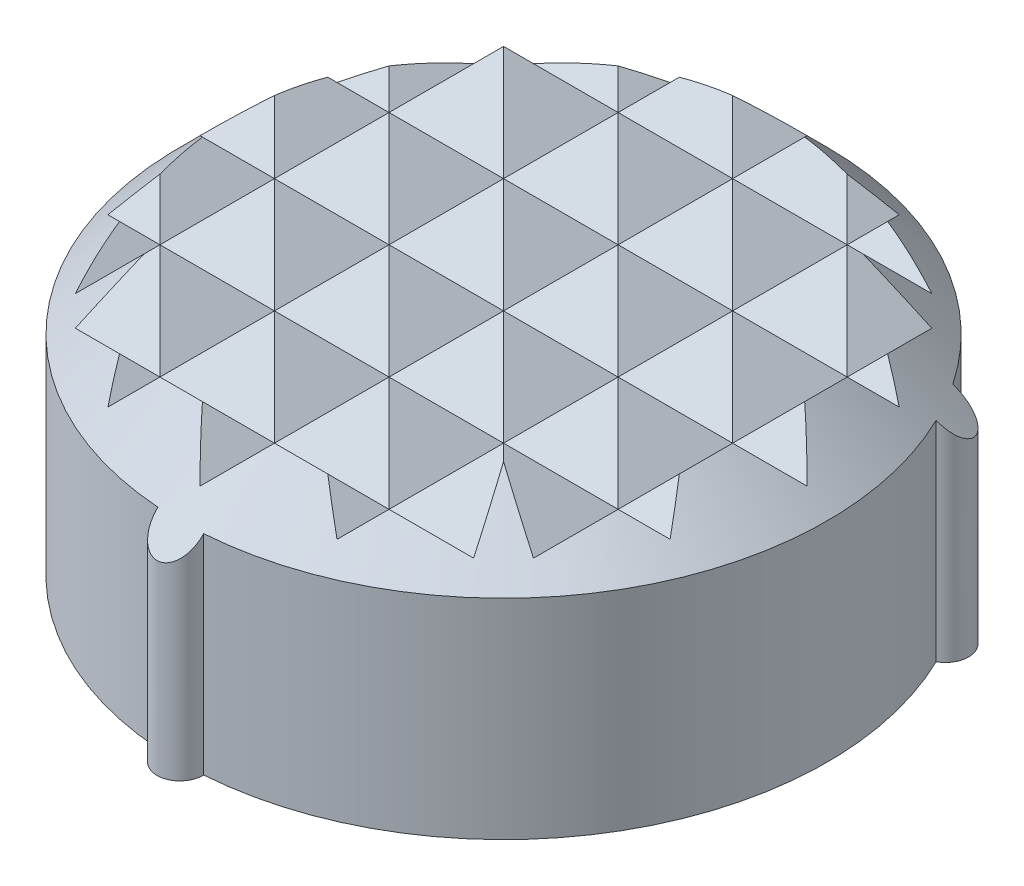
from build123d import *

# Parameters (mm, degrees)
SKETCH1_W             = 6.05
SKETCH1_H             = 5
SKETCH2_R             = 6.55
EXTRUDE1_DEPTH        = 10.909843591
EXTRUDE2_DEPTH        = 10.670832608
LPATTERN1_COUNT       = 8
LPATTERN1_PITCH       = 2
LPATTERN1_COUNT_DIR2  = 8
LPATTERN1_PITCH_DIR2  = 2
MIRROR1_COPY_1_DEPTH  = 10.670832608
MIRROR1_COPY_2_DEPTH  = 10.670832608
MIRROR1_COPY_3_DEPTH  = 10.670832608
MIRROR1_COPY_4_DEPTH  = 10.670832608
MIRROR1_COPY_5_DEPTH  = 10.670832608
MIRROR1_COPY_6_DEPTH  = 10.670832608
MIRROR1_COPY_7_DEPTH  = 10.670832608
MIRROR1_COPY_8_DEPTH  = 10.670832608
MIRROR1_COPY_9_DEPTH  = 10.670832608
MIRROR1_COPY_10_DEPTH = 10.670832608
MIRROR1_COPY_11_DEPTH = 10.670832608
MIRROR1_COPY_12_DEPTH = 10.670832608
MIRROR1_COPY_13_DEPTH = 10.670832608
MIRROR1_COPY_14_DEPTH = 10.670832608
MIRROR1_COPY_15_DEPTH = 10.670832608
MIRROR1_COPY_16_DEPTH = 10.670832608
MIRROR1_COPY_17_DEPTH = 10.670832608
MIRROR1_COPY_18_DEPTH = 10.670832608
MIRROR1_COPY_19_DEPTH = 10.670832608
MIRROR1_COPY_20_DEPTH = 10.670832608
MIRROR1_COPY_21_DEPTH = 10.670832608
MIRROR1_COPY_22_DEPTH = 10.670832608
MIRROR1_COPY_23_DEPTH = 10.670832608
MIRROR1_COPY_24_DEPTH = 10.670832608
MIRROR1_COPY_25_DEPTH = 10.670832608
MIRROR1_COPY_26_DEPTH = 10.670832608
MIRROR1_COPY_27_DEPTH = 10.670832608
MIRROR1_COPY_28_DEPTH = 10.670832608
MIRROR1_COPY_29_DEPTH = 10.670832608
MIRROR1_COPY_30_DEPTH = 10.670832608
MIRROR1_COPY_31_DEPTH = 10.670832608
MIRROR1_COPY_32_DEPTH = 10.670832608
MIRROR1_COPY_33_DEPTH = 10.670832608
MIRROR1_COPY_34_DEPTH = 10.670832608
MIRROR1_COPY_35_DEPTH = 10.670832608
MIRROR1_COPY_36_DEPTH = 10.670832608
MIRROR1_COPY_37_DEPTH = 10.670832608
MIRROR1_COPY_38_DEPTH = 10.670832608
MIRROR1_COPY_39_DEPTH = 10.670832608
MIRROR1_COPY_40_DEPTH = 10.670832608
MIRROR1_COPY_41_DEPTH = 10.670832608
MIRROR1_COPY_42_DEPTH = 10.670832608
MIRROR1_COPY_43_DEPTH = 10.670832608
MIRROR1_COPY_44_DEPTH = 10.670832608
MIRROR1_COPY_45_DEPTH = 10.670832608
MIRROR1_COPY_46_DEPTH = 10.670832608
MIRROR1_COPY_47_DEPTH = 10.670832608
MIRROR1_COPY_48_DEPTH = 10.670832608
MIRROR1_COPY_49_DEPTH = 10.670832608
MIRROR1_COPY_50_DEPTH = 10.670832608
MIRROR1_COPY_51_DEPTH = 10.670832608
MIRROR1_COPY_52_DEPTH = 10.670832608
MIRROR1_COPY_53_DEPTH = 10.670832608
MIRROR1_COPY_54_DEPTH = 10.670832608
MIRROR1_COPY_55_DEPTH = 10.670832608
MIRROR1_COPY_56_DEPTH = 10.670832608
MIRROR1_COPY_57_DEPTH = 10.670832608
MIRROR1_COPY_58_DEPTH = 10.670832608
MIRROR1_COPY_59_DEPTH = 10.670832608
MIRROR1_COPY_60_DEPTH = 10.670832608
MIRROR1_COPY_61_DEPTH = 10.670832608
MIRROR1_COPY_62_DEPTH = 10.670832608
MIRROR1_COPY_63_DEPTH = 10.670832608


with BuildPart() as part:
    # Sketch1 → Revolve1 (revolve)
    with BuildSketch(Plane.XY, mode=Mode.PRIVATE) as revolve1_sk:
        with Locations((3.025, 2.5)):
            Rectangle(SKETCH1_W, SKETCH1_H)
    revolve(revolve1_sk.sketch.rotate(Axis((0, 0, 0), (0, -1, 0)), 90), axis=Axis((0, 0, 0), (0, -1, 0)))

    # Sketch2 → Extrude1 (cut, through all)
    with BuildSketch(Plane(origin=(0, 0, 0), x_dir=(1, 0, 0), z_dir=(0, 1, 0))):
        Circle(SKETCH2_R)
        with BuildLine():
            ThreePointArc((0.399749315, -5.635840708), (4.893043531, -2.825), (5.080655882, 2.471727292))
            ThreePointArc((5.080655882, 2.471727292), (5.239453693, 3.025), (4.680906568, 3.164113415))
            ThreePointArc((4.680906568, 3.164113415), (0, 5.65), (-4.680906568, 3.164113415))
            ThreePointArc((-4.680906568, 3.164113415), (-5.239453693, 3.025), (-5.080655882, 2.471727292))
            ThreePointArc((-5.080655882, 2.471727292), (-4.893043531, -2.825), (-0.399749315, -5.635840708))
            ThreePointArc((-0.399749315, -5.635840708), (0, -6.05), (0.399749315, -5.635840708))
        make_face(mode=Mode.SUBTRACT)
    extrude(amount=EXTRUDE1_DEPTH, mode=Mode.SUBTRACT)

    # Sketch6 → Cut-Revolve1 (revolve, cut)
    with BuildSketch(Plane(origin=(0, 0, 0), x_dir=(0, 0, -1), z_dir=(1, 0, 0)), mode=Mode.PRIVATE) as cut_revolve1_sk:
        Polygon((-8.3, 1), (-8.3, 5), (-4.3, 5), align=None)
    revolve(cut_revolve1_sk.sketch.rotate(Axis((0, 0, 0), (0, 1, 0)), 180), axis=Axis((0, 0, 0), (0, 1, 0)), mode=Mode.SUBTRACT)

    # Sketch5 → Extrude2 (cut, symmetric)
    with BuildSketch(Plane.XY):
        Polygon((1, 5), (0, 4), (-1, 5), align=None)
    extrude2 = extrude(amount=EXTRUDE2_DEPTH, both=True, mode=Mode.SUBTRACT)

    # LPattern1: Extrude2 8 × 8
    with Locations(*[Vector(-1, 0, 0) * (i * LPATTERN1_PITCH) + Vector(1, 0, 0) * (j * LPATTERN1_PITCH_DIR2) for i in range(LPATTERN1_COUNT) for j in range(LPATTERN1_COUNT_DIR2) if (i, j) != (0, 0)]):
        add(extrude2, mode=Mode.SUBTRACT)

    # Mirror1: Extrude2 across plane
    add(extrude2.mirror(Plane(origin=(0, 0, 0), x_dir=(-0.7071067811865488, 0, 0.7071067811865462), z_dir=(0.7071067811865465, 0, 0.7071067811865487))), mode=Mode.SUBTRACT)

    # Mirror1 copy 1 sketch → Mirror1 copy 1 (cut, symmetric)
    with BuildSketch(Plane(origin=(0, 0, -2), x_dir=(0, 0, -1), z_dir=(-1, 0, 0))):
        Polygon((1, -5), (0, -4), (-1, -5), align=None)
    extrude(amount=MIRROR1_COPY_1_DEPTH, both=True, mode=Mode.SUBTRACT)

    # Mirror1 copy 2 sketch → Mirror1 copy 2 (cut, symmetric)
    with BuildSketch(Plane(origin=(0, 0, -4), x_dir=(0, 0, -1), z_dir=(-1, 0, 0))):
        Polygon((1, -5), (0, -4), (-1, -5), align=None)
    extrude(amount=MIRROR1_COPY_2_DEPTH, both=True, mode=Mode.SUBTRACT)

    # Mirror1 copy 3 sketch → Mirror1 copy 3 (cut, symmetric)
    with BuildSketch(Plane(origin=(0, 0, -6), x_dir=(0, 0, -1), z_dir=(-1, 0, 0))):
        Polygon((1, -5), (0, -4), (-1, -5), align=None)
    extrude(amount=MIRROR1_COPY_3_DEPTH, both=True, mode=Mode.SUBTRACT)

    # Mirror1 copy 4 sketch → Mirror1 copy 4 (cut, symmetric)
    with BuildSketch(Plane(origin=(0, 0, -8), x_dir=(0, 0, -1), z_dir=(-1, 0, 0))):
        Polygon((1, -5), (0, -4), (-1, -5), align=None)
    extrude(amount=MIRROR1_COPY_4_DEPTH, both=True, mode=Mode.SUBTRACT)

    # Mirror1 copy 5 sketch → Mirror1 copy 5 (cut, symmetric)
    with BuildSketch(Plane(origin=(0, 0, -10), x_dir=(0, 0, -1), z_dir=(-1, 0, 0))):
        Polygon((1, -5), (0, -4), (-1, -5), align=None)
    extrude(amount=MIRROR1_COPY_5_DEPTH, both=True, mode=Mode.SUBTRACT)

    # Mirror1 copy 6 sketch → Mirror1 copy 6 (cut, symmetric)
    with BuildSketch(Plane(origin=(0, 0, -12), x_dir=(0, 0, -1), z_dir=(-1, 0, 0))):
        Polygon((1, -5), (0, -4), (-1, -5), align=None)
    extrude(amount=MIRROR1_COPY_6_DEPTH, both=True, mode=Mode.SUBTRACT)

    # Mirror1 copy 7 sketch → Mirror1 copy 7 (cut, symmetric)
    with BuildSketch(Plane(origin=(0, 0, -14), x_dir=(0, 0, -1), z_dir=(-1, 0, 0))):
        Polygon((1, -5), (0, -4), (-1, -5), align=None)
    extrude(amount=MIRROR1_COPY_7_DEPTH, both=True, mode=Mode.SUBTRACT)

    # Mirror1 copy 8 sketch → Mirror1 copy 8 (cut, symmetric)
    with BuildSketch(Plane(origin=(0, 0, 2), x_dir=(0, 0, -1), z_dir=(-1, 0, 0))):
        Polygon((1, -5), (0, -4), (-1, -5), align=None)
    extrude(amount=MIRROR1_COPY_8_DEPTH, both=True, mode=Mode.SUBTRACT)

    # Mirror1 copy 9 sketch → Mirror1 copy 9 (cut, symmetric)
    with BuildSketch(Plane(origin=(0, 0, 0), x_dir=(0, 0, -1), z_dir=(-1, 0, 0))):
        Polygon((1, -5), (0, -4), (-1, -5), align=None)
    extrude(amount=MIRROR1_COPY_9_DEPTH, both=True, mode=Mode.SUBTRACT)

    # Mirror1 copy 10 sketch → Mirror1 copy 10 (cut, symmetric)
    with BuildSketch(Plane(origin=(0, 0, -2), x_dir=(0, 0, -1), z_dir=(-1, 0, 0))):
        Polygon((1, -5), (0, -4), (-1, -5), align=None)
    extrude(amount=MIRROR1_COPY_10_DEPTH, both=True, mode=Mode.SUBTRACT)

    # Mirror1 copy 11 sketch → Mirror1 copy 11 (cut, symmetric)
    with BuildSketch(Plane(origin=(0, 0, -4), x_dir=(0, 0, -1), z_dir=(-1, 0, 0))):
        Polygon((1, -5), (0, -4), (-1, -5), align=None)
    extrude(amount=MIRROR1_COPY_11_DEPTH, both=True, mode=Mode.SUBTRACT)

    # Mirror1 copy 12 sketch → Mirror1 copy 12 (cut, symmetric)
    with BuildSketch(Plane(origin=(0, 0, -6), x_dir=(0, 0, -1), z_dir=(-1, 0, 0))):
        Polygon((1, -5), (0, -4), (-1, -5), align=None)
    extrude(amount=MIRROR1_COPY_12_DEPTH, both=True, mode=Mode.SUBTRACT)

    # Mirror1 copy 13 sketch → Mirror1 copy 13 (cut, symmetric)
    with BuildSketch(Plane(origin=(0, 0, -8), x_dir=(0, 0, -1), z_dir=(-1, 0, 0))):
        Polygon((1, -5), (0, -4), (-1, -5), align=None)
    extrude(amount=MIRROR1_COPY_13_DEPTH, both=True, mode=Mode.SUBTRACT)

    # Mirror1 copy 14 sketch → Mirror1 copy 14 (cut, symmetric)
    with BuildSketch(Plane(origin=(0, 0, -10), x_dir=(0, 0, -1), z_dir=(-1, 0, 0))):
        Polygon((1, -5), (0, -4), (-1, -5), align=None)
    extrude(amount=MIRROR1_COPY_14_DEPTH, both=True, mode=Mode.SUBTRACT)

    # Mirror1 copy 15 sketch → Mirror1 copy 15 (cut, symmetric)
    with BuildSketch(Plane(origin=(0, 0, -12), x_dir=(0, 0, -1), z_dir=(-1, 0, 0))):
        Polygon((1, -5), (0, -4), (-1, -5), align=None)
    extrude(amount=MIRROR1_COPY_15_DEPTH, both=True, mode=Mode.SUBTRACT)

    # Mirror1 copy 16 sketch → Mirror1 copy 16 (cut, symmetric)
    with BuildSketch(Plane(origin=(0, 0, 4), x_dir=(0, 0, -1), z_dir=(-1, 0, 0))):
        Polygon((1, -5), (0, -4), (-1, -5), align=None)
    extrude(amount=MIRROR1_COPY_16_DEPTH, both=True, mode=Mode.SUBTRACT)

    # Mirror1 copy 17 sketch → Mirror1 copy 17 (cut, symmetric)
    with BuildSketch(Plane(origin=(0, 0, 2), x_dir=(0, 0, -1), z_dir=(-1, 0, 0))):
        Polygon((1, -5), (0, -4), (-1, -5), align=None)
    extrude(amount=MIRROR1_COPY_17_DEPTH, both=True, mode=Mode.SUBTRACT)

    # Mirror1 copy 18 sketch → Mirror1 copy 18 (cut, symmetric)
    with BuildSketch(Plane(origin=(0, 0, 0), x_dir=(0, 0, -1), z_dir=(-1, 0, 0))):
        Polygon((1, -5), (0, -4), (-1, -5), align=None)
    extrude(amount=MIRROR1_COPY_18_DEPTH, both=True, mode=Mode.SUBTRACT)

    # Mirror1 copy 19 sketch → Mirror1 copy 19 (cut, symmetric)
    with BuildSketch(Plane(origin=(0, 0, -2), x_dir=(0, 0, -1), z_dir=(-1, 0, 0))):
        Polygon((1, -5), (0, -4), (-1, -5), align=None)
    extrude(amount=MIRROR1_COPY_19_DEPTH, both=True, mode=Mode.SUBTRACT)

    # Mirror1 copy 20 sketch → Mirror1 copy 20 (cut, symmetric)
    with BuildSketch(Plane(origin=(0, 0, -4), x_dir=(0, 0, -1), z_dir=(-1, 0, 0))):
        Polygon((1, -5), (0, -4), (-1, -5), align=None)
    extrude(amount=MIRROR1_COPY_20_DEPTH, both=True, mode=Mode.SUBTRACT)

    # Mirror1 copy 21 sketch → Mirror1 copy 21 (cut, symmetric)
    with BuildSketch(Plane(origin=(0, 0, -6), x_dir=(0, 0, -1), z_dir=(-1, 0, 0))):
        Polygon((1, -5), (0, -4), (-1, -5), align=None)
    extrude(amount=MIRROR1_COPY_21_DEPTH, both=True, mode=Mode.SUBTRACT)

    # Mirror1 copy 22 sketch → Mirror1 copy 22 (cut, symmetric)
    with BuildSketch(Plane(origin=(0, 0, -8), x_dir=(0, 0, -1), z_dir=(-1, 0, 0))):
        Polygon((1, -5), (0, -4), (-1, -5), align=None)
    extrude(amount=MIRROR1_COPY_22_DEPTH, both=True, mode=Mode.SUBTRACT)

    # Mirror1 copy 23 sketch → Mirror1 copy 23 (cut, symmetric)
    with BuildSketch(Plane(origin=(0, 0, -10), x_dir=(0, 0, -1), z_dir=(-1, 0, 0))):
        Polygon((1, -5), (0, -4), (-1, -5), align=None)
    extrude(amount=MIRROR1_COPY_23_DEPTH, both=True, mode=Mode.SUBTRACT)

    # Mirror1 copy 24 sketch → Mirror1 copy 24 (cut, symmetric)
    with BuildSketch(Plane(origin=(0, 0, 6), x_dir=(0, 0, -1), z_dir=(-1, 0, 0))):
        Polygon((1, -5), (0, -4), (-1, -5), align=None)
    extrude(amount=MIRROR1_COPY_24_DEPTH, both=True, mode=Mode.SUBTRACT)

    # Mirror1 copy 25 sketch → Mirror1 copy 25 (cut, symmetric)
    with BuildSketch(Plane(origin=(0, 0, 4), x_dir=(0, 0, -1), z_dir=(-1, 0, 0))):
        Polygon((1, -5), (0, -4), (-1, -5), align=None)
    extrude(amount=MIRROR1_COPY_25_DEPTH, both=True, mode=Mode.SUBTRACT)

    # Mirror1 copy 26 sketch → Mirror1 copy 26 (cut, symmetric)
    with BuildSketch(Plane(origin=(0, 0, 2), x_dir=(0, 0, -1), z_dir=(-1, 0, 0))):
        Polygon((1, -5), (0, -4), (-1, -5), align=None)
    extrude(amount=MIRROR1_COPY_26_DEPTH, both=True, mode=Mode.SUBTRACT)

    # Mirror1 copy 27 sketch → Mirror1 copy 27 (cut, symmetric)
    with BuildSketch(Plane(origin=(0, 0, 0), x_dir=(0, 0, -1), z_dir=(-1, 0, 0))):
        Polygon((1, -5), (0, -4), (-1, -5), align=None)
    extrude(amount=MIRROR1_COPY_27_DEPTH, both=True, mode=Mode.SUBTRACT)

    # Mirror1 copy 28 sketch → Mirror1 copy 28 (cut, symmetric)
    with BuildSketch(Plane(origin=(0, 0, -2), x_dir=(0, 0, -1), z_dir=(-1, 0, 0))):
        Polygon((1, -5), (0, -4), (-1, -5), align=None)
    extrude(amount=MIRROR1_COPY_28_DEPTH, both=True, mode=Mode.SUBTRACT)

    # Mirror1 copy 29 sketch → Mirror1 copy 29 (cut, symmetric)
    with BuildSketch(Plane(origin=(0, 0, -4), x_dir=(0, 0, -1), z_dir=(-1, 0, 0))):
        Polygon((1, -5), (0, -4), (-1, -5), align=None)
    extrude(amount=MIRROR1_COPY_29_DEPTH, both=True, mode=Mode.SUBTRACT)

    # Mirror1 copy 30 sketch → Mirror1 copy 30 (cut, symmetric)
    with BuildSketch(Plane(origin=(0, 0, -6), x_dir=(0, 0, -1), z_dir=(-1, 0, 0))):
        Polygon((1, -5), (0, -4), (-1, -5), align=None)
    extrude(amount=MIRROR1_COPY_30_DEPTH, both=True, mode=Mode.SUBTRACT)

    # Mirror1 copy 31 sketch → Mirror1 copy 31 (cut, symmetric)
    with BuildSketch(Plane(origin=(0, 0, -8), x_dir=(0, 0, -1), z_dir=(-1, 0, 0))):
        Polygon((1, -5), (0, -4), (-1, -5), align=None)
    extrude(amount=MIRROR1_COPY_31_DEPTH, both=True, mode=Mode.SUBTRACT)

    # Mirror1 copy 32 sketch → Mirror1 copy 32 (cut, symmetric)
    with BuildSketch(Plane(origin=(0, 0, 8), x_dir=(0, 0, -1), z_dir=(-1, 0, 0))):
        Polygon((1, -5), (0, -4), (-1, -5), align=None)
    extrude(amount=MIRROR1_COPY_32_DEPTH, both=True, mode=Mode.SUBTRACT)

    # Mirror1 copy 33 sketch → Mirror1 copy 33 (cut, symmetric)
    with BuildSketch(Plane(origin=(0, 0, 6), x_dir=(0, 0, -1), z_dir=(-1, 0, 0))):
        Polygon((1, -5), (0, -4), (-1, -5), align=None)
    extrude(amount=MIRROR1_COPY_33_DEPTH, both=True, mode=Mode.SUBTRACT)

    # Mirror1 copy 34 sketch → Mirror1 copy 34 (cut, symmetric)
    with BuildSketch(Plane(origin=(0, 0, 4), x_dir=(0, 0, -1), z_dir=(-1, 0, 0))):
        Polygon((1, -5), (0, -4), (-1, -5), align=None)
    extrude(amount=MIRROR1_COPY_34_DEPTH, both=True, mode=Mode.SUBTRACT)

    # Mirror1 copy 35 sketch → Mirror1 copy 35 (cut, symmetric)
    with BuildSketch(Plane(origin=(0, 0, 2), x_dir=(0, 0, -1), z_dir=(-1, 0, 0))):
        Polygon((1, -5), (0, -4), (-1, -5), align=None)
    extrude(amount=MIRROR1_COPY_35_DEPTH, both=True, mode=Mode.SUBTRACT)

    # Mirror1 copy 36 sketch → Mirror1 copy 36 (cut, symmetric)
    with BuildSketch(Plane(origin=(0, 0, 0), x_dir=(0, 0, -1), z_dir=(-1, 0, 0))):
        Polygon((1, -5), (0, -4), (-1, -5), align=None)
    extrude(amount=MIRROR1_COPY_36_DEPTH, both=True, mode=Mode.SUBTRACT)

    # Mirror1 copy 37 sketch → Mirror1 copy 37 (cut, symmetric)
    with BuildSketch(Plane(origin=(0, 0, -2), x_dir=(0, 0, -1), z_dir=(-1, 0, 0))):
        Polygon((1, -5), (0, -4), (-1, -5), align=None)
    extrude(amount=MIRROR1_COPY_37_DEPTH, both=True, mode=Mode.SUBTRACT)

    # Mirror1 copy 38 sketch → Mirror1 copy 38 (cut, symmetric)
    with BuildSketch(Plane(origin=(0, 0, -4), x_dir=(0, 0, -1), z_dir=(-1, 0, 0))):
        Polygon((1, -5), (0, -4), (-1, -5), align=None)
    extrude(amount=MIRROR1_COPY_38_DEPTH, both=True, mode=Mode.SUBTRACT)

    # Mirror1 copy 39 sketch → Mirror1 copy 39 (cut, symmetric)
    with BuildSketch(Plane(origin=(0, 0, -6), x_dir=(0, 0, -1), z_dir=(-1, 0, 0))):
        Polygon((1, -5), (0, -4), (-1, -5), align=None)
    extrude(amount=MIRROR1_COPY_39_DEPTH, both=True, mode=Mode.SUBTRACT)

    # Mirror1 copy 40 sketch → Mirror1 copy 40 (cut, symmetric)
    with BuildSketch(Plane(origin=(0, 0, 10), x_dir=(0, 0, -1), z_dir=(-1, 0, 0))):
        Polygon((1, -5), (0, -4), (-1, -5), align=None)
    extrude(amount=MIRROR1_COPY_40_DEPTH, both=True, mode=Mode.SUBTRACT)

    # Mirror1 copy 41 sketch → Mirror1 copy 41 (cut, symmetric)
    with BuildSketch(Plane(origin=(0, 0, 8), x_dir=(0, 0, -1), z_dir=(-1, 0, 0))):
        Polygon((1, -5), (0, -4), (-1, -5), align=None)
    extrude(amount=MIRROR1_COPY_41_DEPTH, both=True, mode=Mode.SUBTRACT)

    # Mirror1 copy 42 sketch → Mirror1 copy 42 (cut, symmetric)
    with BuildSketch(Plane(origin=(0, 0, 6), x_dir=(0, 0, -1), z_dir=(-1, 0, 0))):
        Polygon((1, -5), (0, -4), (-1, -5), align=None)
    extrude(amount=MIRROR1_COPY_42_DEPTH, both=True, mode=Mode.SUBTRACT)

    # Mirror1 copy 43 sketch → Mirror1 copy 43 (cut, symmetric)
    with BuildSketch(Plane(origin=(0, 0, 4), x_dir=(0, 0, -1), z_dir=(-1, 0, 0))):
        Polygon((1, -5), (0, -4), (-1, -5), align=None)
    extrude(amount=MIRROR1_COPY_43_DEPTH, both=True, mode=Mode.SUBTRACT)

    # Mirror1 copy 44 sketch → Mirror1 copy 44 (cut, symmetric)
    with BuildSketch(Plane(origin=(0, 0, 2), x_dir=(0, 0, -1), z_dir=(-1, 0, 0))):
        Polygon((1, -5), (0, -4), (-1, -5), align=None)
    extrude(amount=MIRROR1_COPY_44_DEPTH, both=True, mode=Mode.SUBTRACT)

    # Mirror1 copy 45 sketch → Mirror1 copy 45 (cut, symmetric)
    with BuildSketch(Plane(origin=(0, 0, 0), x_dir=(0, 0, -1), z_dir=(-1, 0, 0))):
        Polygon((1, -5), (0, -4), (-1, -5), align=None)
    extrude(amount=MIRROR1_COPY_45_DEPTH, both=True, mode=Mode.SUBTRACT)

    # Mirror1 copy 46 sketch → Mirror1 copy 46 (cut, symmetric)
    with BuildSketch(Plane(origin=(0, 0, -2), x_dir=(0, 0, -1), z_dir=(-1, 0, 0))):
        Polygon((1, -5), (0, -4), (-1, -5), align=None)
    extrude(amount=MIRROR1_COPY_46_DEPTH, both=True, mode=Mode.SUBTRACT)

    # Mirror1 copy 47 sketch → Mirror1 copy 47 (cut, symmetric)
    with BuildSketch(Plane(origin=(0, 0, -4), x_dir=(0, 0, -1), z_dir=(-1, 0, 0))):
        Polygon((1, -5), (0, -4), (-1, -5), align=None)
    extrude(amount=MIRROR1_COPY_47_DEPTH, both=True, mode=Mode.SUBTRACT)

    # Mirror1 copy 48 sketch → Mirror1 copy 48 (cut, symmetric)
    with BuildSketch(Plane(origin=(0, 0, 12), x_dir=(0, 0, -1), z_dir=(-1, 0, 0))):
        Polygon((1, -5), (0, -4), (-1, -5), align=None)
    extrude(amount=MIRROR1_COPY_48_DEPTH, both=True, mode=Mode.SUBTRACT)

    # Mirror1 copy 49 sketch → Mirror1 copy 49 (cut, symmetric)
    with BuildSketch(Plane(origin=(0, 0, 10), x_dir=(0, 0, -1), z_dir=(-1, 0, 0))):
        Polygon((1, -5), (0, -4), (-1, -5), align=None)
    extrude(amount=MIRROR1_COPY_49_DEPTH, both=True, mode=Mode.SUBTRACT)

    # Mirror1 copy 50 sketch → Mirror1 copy 50 (cut, symmetric)
    with BuildSketch(Plane(origin=(0, 0, 8), x_dir=(0, 0, -1), z_dir=(-1, 0, 0))):
        Polygon((1, -5), (0, -4), (-1, -5), align=None)
    extrude(amount=MIRROR1_COPY_50_DEPTH, both=True, mode=Mode.SUBTRACT)

    # Mirror1 copy 51 sketch → Mirror1 copy 51 (cut, symmetric)
    with BuildSketch(Plane(origin=(0, 0, 6), x_dir=(0, 0, -1), z_dir=(-1, 0, 0))):
        Polygon((1, -5), (0, -4), (-1, -5), align=None)
    extrude(amount=MIRROR1_COPY_51_DEPTH, both=True, mode=Mode.SUBTRACT)

    # Mirror1 copy 52 sketch → Mirror1 copy 52 (cut, symmetric)
    with BuildSketch(Plane(origin=(0, 0, 4), x_dir=(0, 0, -1), z_dir=(-1, 0, 0))):
        Polygon((1, -5), (0, -4), (-1, -5), align=None)
    extrude(amount=MIRROR1_COPY_52_DEPTH, both=True, mode=Mode.SUBTRACT)

    # Mirror1 copy 53 sketch → Mirror1 copy 53 (cut, symmetric)
    with BuildSketch(Plane(origin=(0, 0, 2), x_dir=(0, 0, -1), z_dir=(-1, 0, 0))):
        Polygon((1, -5), (0, -4), (-1, -5), align=None)
    extrude(amount=MIRROR1_COPY_53_DEPTH, both=True, mode=Mode.SUBTRACT)

    # Mirror1 copy 54 sketch → Mirror1 copy 54 (cut, symmetric)
    with BuildSketch(Plane(origin=(0, 0, 0), x_dir=(0, 0, -1), z_dir=(-1, 0, 0))):
        Polygon((1, -5), (0, -4), (-1, -5), align=None)
    extrude(amount=MIRROR1_COPY_54_DEPTH, both=True, mode=Mode.SUBTRACT)

    # Mirror1 copy 55 sketch → Mirror1 copy 55 (cut, symmetric)
    with BuildSketch(Plane(origin=(0, 0, -2), x_dir=(0, 0, -1), z_dir=(-1, 0, 0))):
        Polygon((1, -5), (0, -4), (-1, -5), align=None)
    extrude(amount=MIRROR1_COPY_55_DEPTH, both=True, mode=Mode.SUBTRACT)

    # Mirror1 copy 56 sketch → Mirror1 copy 56 (cut, symmetric)
    with BuildSketch(Plane(origin=(0, 0, 14), x_dir=(0, 0, -1), z_dir=(-1, 0, 0))):
        Polygon((1, -5), (0, -4), (-1, -5), align=None)
    extrude(amount=MIRROR1_COPY_56_DEPTH, both=True, mode=Mode.SUBTRACT)

    # Mirror1 copy 57 sketch → Mirror1 copy 57 (cut, symmetric)
    with BuildSketch(Plane(origin=(0, 0, 12), x_dir=(0, 0, -1), z_dir=(-1, 0, 0))):
        Polygon((1, -5), (0, -4), (-1, -5), align=None)
    extrude(amount=MIRROR1_COPY_57_DEPTH, both=True, mode=Mode.SUBTRACT)

    # Mirror1 copy 58 sketch → Mirror1 copy 58 (cut, symmetric)
    with BuildSketch(Plane(origin=(0, 0, 10), x_dir=(0, 0, -1), z_dir=(-1, 0, 0))):
        Polygon((1, -5), (0, -4), (-1, -5), align=None)
    extrude(amount=MIRROR1_COPY_58_DEPTH, both=True, mode=Mode.SUBTRACT)

    # Mirror1 copy 59 sketch → Mirror1 copy 59 (cut, symmetric)
    with BuildSketch(Plane(origin=(0, 0, 8), x_dir=(0, 0, -1), z_dir=(-1, 0, 0))):
        Polygon((1, -5), (0, -4), (-1, -5), align=None)
    extrude(amount=MIRROR1_COPY_59_DEPTH, both=True, mode=Mode.SUBTRACT)

    # Mirror1 copy 60 sketch → Mirror1 copy 60 (cut, symmetric)
    with BuildSketch(Plane(origin=(0, 0, 6), x_dir=(0, 0, -1), z_dir=(-1, 0, 0))):
        Polygon((1, -5), (0, -4), (-1, -5), align=None)
    extrude(amount=MIRROR1_COPY_60_DEPTH, both=True, mode=Mode.SUBTRACT)

    # Mirror1 copy 61 sketch → Mirror1 copy 61 (cut, symmetric)
    with BuildSketch(Plane(origin=(0, 0, 4), x_dir=(0, 0, -1), z_dir=(-1, 0, 0))):
        Polygon((1, -5), (0, -4), (-1, -5), align=None)
    extrude(amount=MIRROR1_COPY_61_DEPTH, both=True, mode=Mode.SUBTRACT)

    # Mirror1 copy 62 sketch → Mirror1 copy 62 (cut, symmetric)
    with BuildSketch(Plane(origin=(0, 0, 2), x_dir=(0, 0, -1), z_dir=(-1, 0, 0))):
        Polygon((1, -5), (0, -4), (-1, -5), align=None)
    extrude(amount=MIRROR1_COPY_62_DEPTH, both=True, mode=Mode.SUBTRACT)

    # Mirror1 copy 63 sketch → Mirror1 copy 63 (cut, symmetric)
    with BuildSketch(Plane(origin=(0, 0, 0), x_dir=(0, 0, -1), z_dir=(-1, 0, 0))):
        Polygon((1, -5), (0, -4), (-1, -5), align=None)
    extrude(amount=MIRROR1_COPY_63_DEPTH, both=True, mode=Mode.SUBTRACT)


solid = part.part
